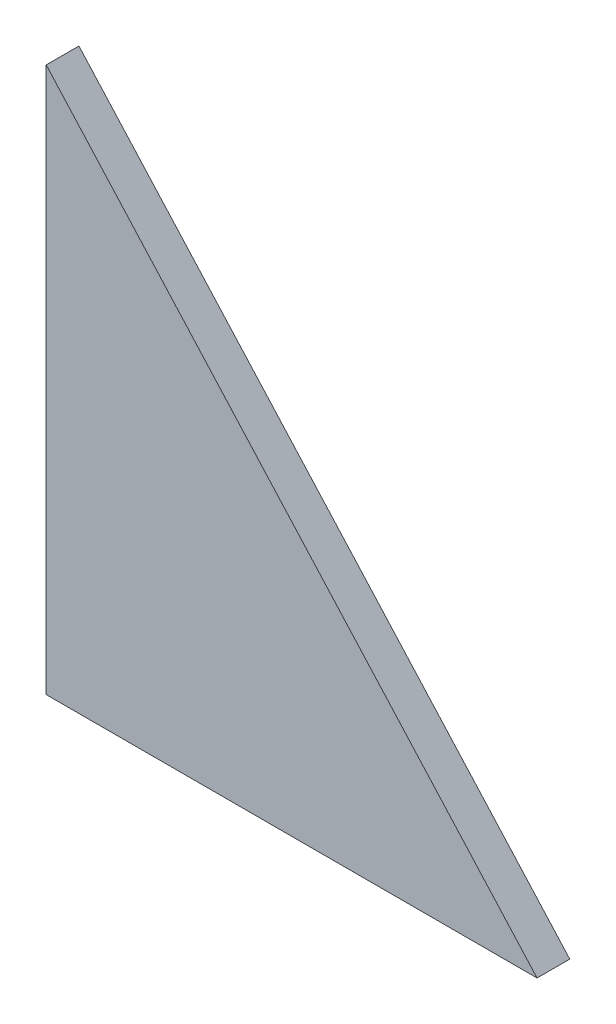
ISO-10303-21;
HEADER;
FILE_DESCRIPTION(('STEP AP214'),'2;1');
FILE_NAME('part.step','',(''),(''),'','','');
FILE_SCHEMA(('AUTOMOTIVE_DESIGN { 1 0 10303 214 1 1 1 1 }'));
ENDSEC;
DATA;
#1=APPLICATION_CONTEXT('core data for automotive mechanical design processes');
#2=APPLICATION_PROTOCOL_DEFINITION('international standard','automotive_design',2000,#1);
#3=PRODUCT_CONTEXT('',#1,'mechanical');
#4=PRODUCT('Part','Part','',(#3));
#5=PRODUCT_RELATED_PRODUCT_CATEGORY('part','',(#4));
#6=PRODUCT_DEFINITION_FORMATION('','',#4);
#7=PRODUCT_DEFINITION_CONTEXT('part definition',#1,'design');
#8=PRODUCT_DEFINITION('design','',#6,#7);
#9=PRODUCT_DEFINITION_SHAPE('','',#8);
#10=(LENGTH_UNIT() NAMED_UNIT(*) SI_UNIT(.MILLI.,.METRE.));
#11=(NAMED_UNIT(*) PLANE_ANGLE_UNIT() SI_UNIT($,.RADIAN.));
#12=(NAMED_UNIT(*) SI_UNIT($,.STERADIAN.) SOLID_ANGLE_UNIT());
#13=UNCERTAINTY_MEASURE_WITH_UNIT(LENGTH_MEASURE(1.E-05),#10,'distance_accuracy_value','');
#14=(GEOMETRIC_REPRESENTATION_CONTEXT(3) GLOBAL_UNCERTAINTY_ASSIGNED_CONTEXT((#13)) GLOBAL_UNIT_ASSIGNED_CONTEXT((#10,
#11,#12)) REPRESENTATION_CONTEXT('',''));
#15=CARTESIAN_POINT('',(0.,0.,0.));
#16=DIRECTION('',(0.,0.,1.));
#17=DIRECTION('',(1.,0.,0.));
#18=AXIS2_PLACEMENT_3D('',#15,#16,#17);
#19=CARTESIAN_POINT('',(90.,0.,6.));
#20=DIRECTION('',(-0.743294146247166,-0.66896473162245,0.));
#21=DIRECTION('',(0.66896473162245,-0.743294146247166,0.));
#22=AXIS2_PLACEMENT_3D('',#19,#20,#21);
#23=PLANE('',#22);
#24=DIRECTION('',(-0.66896473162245,0.743294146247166,0.));
#25=VECTOR('',#24,1.);
#26=CARTESIAN_POINT('',(90.,0.,0.));
#27=LINE('',#26,#25);
#28=CARTESIAN_POINT('',(90.,0.,0.));
#29=VERTEX_POINT('',#28);
#30=CARTESIAN_POINT('',(0.,100.,0.));
#31=VERTEX_POINT('',#30);
#32=EDGE_CURVE('E86',#29,#31,#27,.T.);
#33=ORIENTED_EDGE('',*,*,#32,.T.);
#34=DIRECTION('',(0.,0.,-1.));
#35=VECTOR('',#34,1.);
#36=CARTESIAN_POINT('',(0.,100.,6.));
#37=LINE('',#36,#35);
#38=CARTESIAN_POINT('',(0.,100.,6.));
#39=VERTEX_POINT('',#38);
#40=EDGE_CURVE('E11',#39,#31,#37,.T.);
#41=ORIENTED_EDGE('',*,*,#40,.F.);
#42=DIRECTION('',(-0.66896473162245,0.743294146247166,0.));
#43=VECTOR('',#42,1.);
#44=CARTESIAN_POINT('',(90.,0.,6.));
#45=LINE('',#44,#43);
#46=CARTESIAN_POINT('',(90.,0.,6.));
#47=VERTEX_POINT('',#46);
#48=EDGE_CURVE('E79',#47,#39,#45,.T.);
#49=ORIENTED_EDGE('',*,*,#48,.F.);
#50=DIRECTION('',(0.,0.,-1.));
#51=VECTOR('',#50,1.);
#52=CARTESIAN_POINT('',(90.,0.,6.));
#53=LINE('',#52,#51);
#54=EDGE_CURVE('E87',#47,#29,#53,.T.);
#55=ORIENTED_EDGE('',*,*,#54,.T.);
#56=EDGE_LOOP('',(#33,#41,#49,#55));
#57=FACE_BOUND('',#56,.T.);
#58=ADVANCED_FACE('F39',(#57),#23,.F.);
#59=CARTESIAN_POINT('',(0.,100.,6.));
#60=DIRECTION('',(1.,0.,0.));
#61=DIRECTION('',(0.,1.,0.));
#62=AXIS2_PLACEMENT_3D('',#59,#60,#61);
#63=PLANE('',#62);
#64=DIRECTION('',(0.,-1.,0.));
#65=VECTOR('',#64,1.);
#66=CARTESIAN_POINT('',(0.,100.,0.));
#67=LINE('',#66,#65);
#68=CARTESIAN_POINT('',(0.,0.,0.));
#69=VERTEX_POINT('',#68);
#70=EDGE_CURVE('E67',#31,#69,#67,.T.);
#71=ORIENTED_EDGE('',*,*,#70,.T.);
#72=DIRECTION('',(0.,0.,-1.));
#73=VECTOR('',#72,1.);
#74=CARTESIAN_POINT('',(0.,0.,6.));
#75=LINE('',#74,#73);
#76=CARTESIAN_POINT('',(0.,0.,6.));
#77=VERTEX_POINT('',#76);
#78=EDGE_CURVE('E47',#77,#69,#75,.T.);
#79=ORIENTED_EDGE('',*,*,#78,.F.);
#80=DIRECTION('',(0.,-1.,0.));
#81=VECTOR('',#80,1.);
#82=CARTESIAN_POINT('',(0.,100.,6.));
#83=LINE('',#82,#81);
#84=EDGE_CURVE('E75',#39,#77,#83,.T.);
#85=ORIENTED_EDGE('',*,*,#84,.F.);
#86=ORIENTED_EDGE('',*,*,#40,.T.);
#87=EDGE_LOOP('',(#71,#79,#85,#86));
#88=FACE_BOUND('',#87,.T.);
#89=ADVANCED_FACE('F76',(#88),#63,.F.);
#90=CARTESIAN_POINT('',(0.,0.,6.));
#91=DIRECTION('',(0.,1.,0.));
#92=DIRECTION('',(0.,0.,1.));
#93=AXIS2_PLACEMENT_3D('',#90,#91,#92);
#94=PLANE('',#93);
#95=DIRECTION('',(1.,0.,0.));
#96=VECTOR('',#95,1.);
#97=CARTESIAN_POINT('',(0.,0.,0.));
#98=LINE('',#97,#96);
#99=EDGE_CURVE('E72',#69,#29,#98,.T.);
#100=ORIENTED_EDGE('',*,*,#99,.T.);
#101=ORIENTED_EDGE('',*,*,#54,.F.);
#102=DIRECTION('',(1.,0.,0.));
#103=VECTOR('',#102,1.);
#104=CARTESIAN_POINT('',(0.,0.,6.));
#105=LINE('',#104,#103);
#106=EDGE_CURVE('E55',#77,#47,#105,.T.);
#107=ORIENTED_EDGE('',*,*,#106,.F.);
#108=ORIENTED_EDGE('',*,*,#78,.T.);
#109=EDGE_LOOP('',(#100,#101,#107,#108));
#110=FACE_BOUND('',#109,.T.);
#111=ADVANCED_FACE('F94',(#110),#94,.F.);
#112=CARTESIAN_POINT('',(89.9999999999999,0.,6.));
#113=DIRECTION('',(0.,0.,-1.));
#114=DIRECTION('',(-1.,0.,0.));
#115=AXIS2_PLACEMENT_3D('',#112,#113,#114);
#116=PLANE('',#115);
#117=ORIENTED_EDGE('',*,*,#48,.T.);
#118=ORIENTED_EDGE('',*,*,#84,.T.);
#119=ORIENTED_EDGE('',*,*,#106,.T.);
#120=EDGE_LOOP('',(#117,#118,#119));
#121=FACE_BOUND('',#120,.T.);
#122=ADVANCED_FACE('F82',(#121),#116,.F.);
#123=CARTESIAN_POINT('',(89.9999999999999,0.,0.));
#124=DIRECTION('',(0.,0.,-1.));
#125=DIRECTION('',(-1.,0.,0.));
#126=AXIS2_PLACEMENT_3D('',#123,#124,#125);
#127=PLANE('',#126);
#128=ORIENTED_EDGE('',*,*,#32,.F.);
#129=ORIENTED_EDGE('',*,*,#99,.F.);
#130=ORIENTED_EDGE('',*,*,#70,.F.);
#131=EDGE_LOOP('',(#128,#129,#130));
#132=FACE_BOUND('',#131,.T.);
#133=ADVANCED_FACE('F95',(#132),#127,.T.);
#134=CLOSED_SHELL('',(#58,#89,#111,#122,#133));
#135=MANIFOLD_SOLID_BREP('B2',#134);
#136=ADVANCED_BREP_SHAPE_REPRESENTATION('',(#18,#135),#14);
#137=SHAPE_DEFINITION_REPRESENTATION(#9,#136);
ENDSEC;
END-ISO-10303-21;
